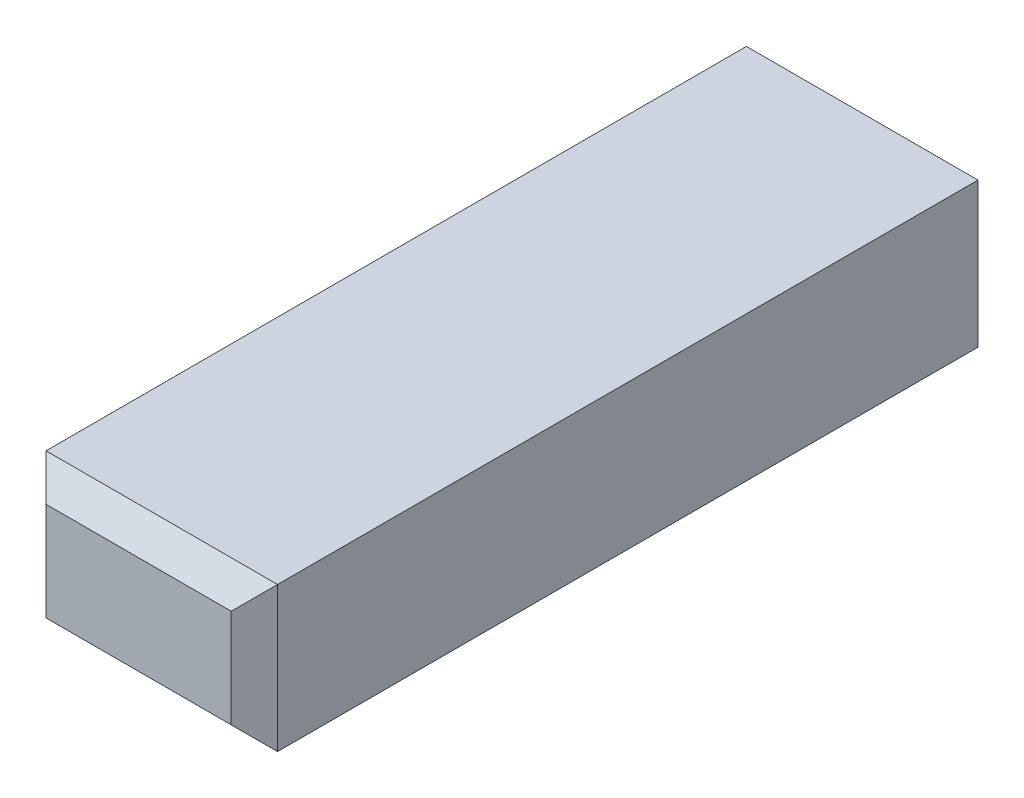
from build123d import *

# Parameters (mm, degrees)
SKETCH1_W           = 16
SKETCH1_H           = 10
BOSS_EXTRUDE1_DEPTH = 25
CHAMFER1_SIZE       = 1.6


with BuildPart() as part:
    # Sketch1 → Boss-Extrude1 (new, symmetric)
    with BuildSketch(Plane.XY):
        Rectangle(SKETCH1_W, SKETCH1_H)
    extrude(amount=BOSS_EXTRUDE1_DEPTH, both=True)

    # Chamfer1
    chamfer1_edges = [part.edges().sort_by_distance(p)[0] for p in [
        (-8, 0, 25),
        (0, -5, 25),
        (8, 0, 25),
        (0, 5, 25),
    ]]
    chamfer(chamfer1_edges, length=CHAMFER1_SIZE)


solid = part.part
